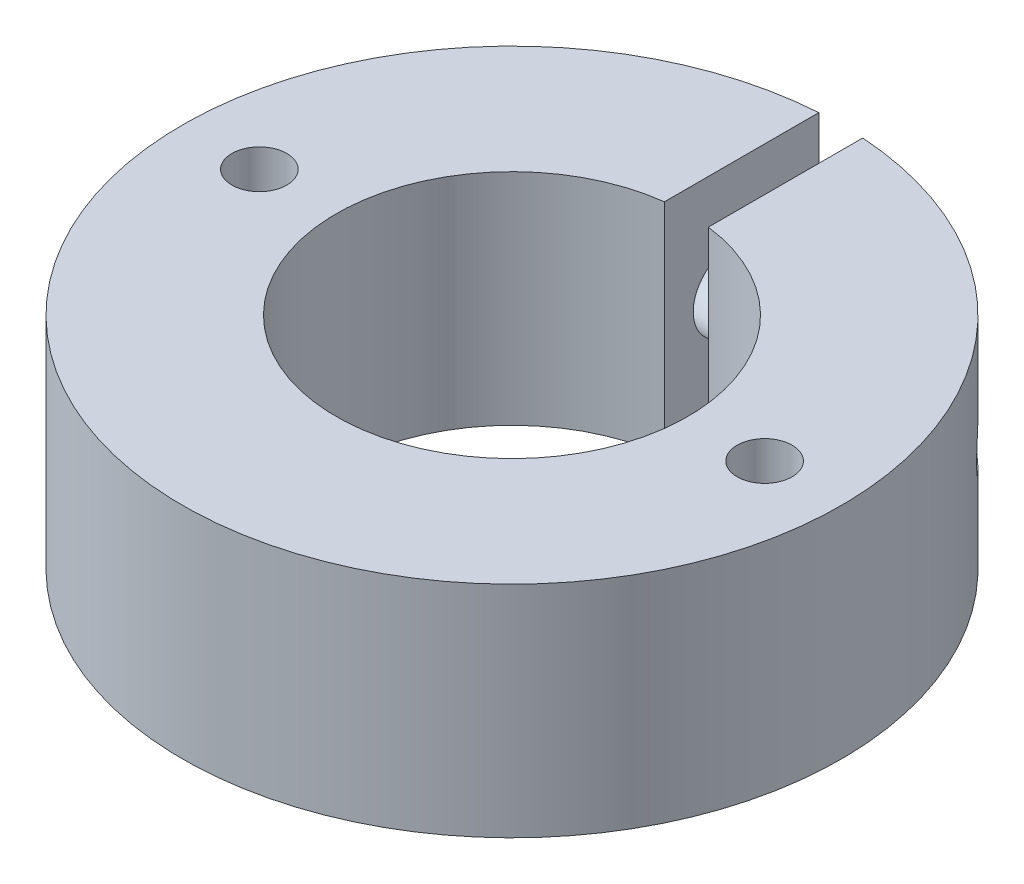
ISO-10303-21;
HEADER;
FILE_DESCRIPTION(('STEP AP214'),'2;1');
FILE_NAME('part.step','',(''),(''),'','','');
FILE_SCHEMA(('AUTOMOTIVE_DESIGN { 1 0 10303 214 1 1 1 1 }'));
ENDSEC;
DATA;
#1=APPLICATION_CONTEXT('core data for automotive mechanical design processes');
#2=APPLICATION_PROTOCOL_DEFINITION('international standard','automotive_design',2000,#1);
#3=PRODUCT_CONTEXT('',#1,'mechanical');
#4=PRODUCT('Part','Part','',(#3));
#5=PRODUCT_RELATED_PRODUCT_CATEGORY('part','',(#4));
#6=PRODUCT_DEFINITION_FORMATION('','',#4);
#7=PRODUCT_DEFINITION_CONTEXT('part definition',#1,'design');
#8=PRODUCT_DEFINITION('design','',#6,#7);
#9=PRODUCT_DEFINITION_SHAPE('','',#8);
#10=(LENGTH_UNIT() NAMED_UNIT(*) SI_UNIT(.MILLI.,.METRE.));
#11=(NAMED_UNIT(*) PLANE_ANGLE_UNIT() SI_UNIT($,.RADIAN.));
#12=(NAMED_UNIT(*) SI_UNIT($,.STERADIAN.) SOLID_ANGLE_UNIT());
#13=UNCERTAINTY_MEASURE_WITH_UNIT(LENGTH_MEASURE(1.E-05),#10,'distance_accuracy_value','');
#14=(GEOMETRIC_REPRESENTATION_CONTEXT(3) GLOBAL_UNCERTAINTY_ASSIGNED_CONTEXT((#13)) GLOBAL_UNIT_ASSIGNED_CONTEXT((#10,
#11,#12)) REPRESENTATION_CONTEXT('',''));
#15=CARTESIAN_POINT('',(0.,0.,0.));
#16=DIRECTION('',(0.,0.,1.));
#17=DIRECTION('',(1.,0.,0.));
#18=AXIS2_PLACEMENT_3D('',#15,#16,#17);
#19=CARTESIAN_POINT('',(-11.5,12.99999999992,0.));
#20=DIRECTION('',(0.,1.,0.));
#21=DIRECTION('',(0.,0.,1.));
#22=AXIS2_PLACEMENT_3D('',#19,#20,#21);
#23=CONICAL_SURFACE('',#22,1.24999999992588,1.0297442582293);
#24=CARTESIAN_POINT('',(-11.5,12.2489242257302,0.));
#25=VERTEX_POINT('',#24);
#26=VERTEX_LOOP('',#25);
#27=FACE_BOUND('',#26,.T.);
#28=CARTESIAN_POINT('',(-11.5,13.,0.));
#29=DIRECTION('',(0.,1.,0.));
#30=DIRECTION('',(0.,0.,1.));
#31=AXIS2_PLACEMENT_3D('',#28,#29,#30);
#32=CIRCLE('',#31,1.24999999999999);
#33=CARTESIAN_POINT('',(-11.5,13.,1.25));
#34=VERTEX_POINT('',#33);
#35=EDGE_CURVE('E92',#34,#34,#32,.T.);
#36=ORIENTED_EDGE('',*,*,#35,.T.);
#37=EDGE_LOOP('',(#36));
#38=FACE_BOUND('',#37,.T.);
#39=ADVANCED_FACE('F17',(#27,#38),#23,.F.);
#40=CARTESIAN_POINT('',(11.5,12.99999999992,0.));
#41=DIRECTION('',(0.,1.,0.));
#42=DIRECTION('',(-1.,0.,0.));
#43=AXIS2_PLACEMENT_3D('',#40,#41,#42);
#44=CONICAL_SURFACE('',#43,1.24999999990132,1.02974425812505);
#45=CARTESIAN_POINT('',(11.5,12.2489242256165,0.));
#46=VERTEX_POINT('',#45);
#47=VERTEX_LOOP('',#46);
#48=FACE_BOUND('',#47,.T.);
#49=CARTESIAN_POINT('',(11.5,13.,0.));
#50=DIRECTION('',(0.,1.,0.));
#51=DIRECTION('',(0.,0.,1.));
#52=AXIS2_PLACEMENT_3D('',#49,#50,#51);
#53=CIRCLE('',#52,1.24999999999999);
#54=CARTESIAN_POINT('',(11.5,13.,1.25));
#55=VERTEX_POINT('',#54);
#56=EDGE_CURVE('E94',#55,#55,#53,.T.);
#57=ORIENTED_EDGE('',*,*,#56,.T.);
#58=EDGE_LOOP('',(#57));
#59=FACE_BOUND('',#58,.T.);
#60=ADVANCED_FACE('F89',(#48,#59),#44,.F.);
#61=CARTESIAN_POINT('',(-11.5,22.,0.));
#62=DIRECTION('',(0.,1.,0.));
#63=DIRECTION('',(0.,0.,1.));
#64=AXIS2_PLACEMENT_3D('',#61,#62,#63);
#65=CYLINDRICAL_SURFACE('',#64,1.24999999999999);
#66=ORIENTED_EDGE('',*,*,#35,.F.);
#67=EDGE_LOOP('',(#66));
#68=FACE_BOUND('',#67,.T.);
#69=CARTESIAN_POINT('',(-11.5,22.,0.));
#70=DIRECTION('',(0.,1.,0.));
#71=DIRECTION('',(0.,0.,1.));
#72=AXIS2_PLACEMENT_3D('',#69,#70,#71);
#73=CIRCLE('',#72,1.24999999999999);
#74=CARTESIAN_POINT('',(-11.5,22.,1.25));
#75=VERTEX_POINT('',#74);
#76=EDGE_CURVE('E165',#75,#75,#73,.F.);
#77=ORIENTED_EDGE('',*,*,#76,.F.);
#78=EDGE_LOOP('',(#77));
#79=FACE_BOUND('',#78,.T.);
#80=ADVANCED_FACE('F150',(#68,#79),#65,.F.);
#81=CARTESIAN_POINT('',(11.5,22.,0.));
#82=DIRECTION('',(0.,1.,0.));
#83=DIRECTION('',(0.,0.,1.));
#84=AXIS2_PLACEMENT_3D('',#81,#82,#83);
#85=CYLINDRICAL_SURFACE('',#84,1.24999999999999);
#86=ORIENTED_EDGE('',*,*,#56,.F.);
#87=EDGE_LOOP('',(#86));
#88=FACE_BOUND('',#87,.T.);
#89=CARTESIAN_POINT('',(11.5,22.,0.));
#90=DIRECTION('',(0.,1.,0.));
#91=DIRECTION('',(0.,0.,1.));
#92=AXIS2_PLACEMENT_3D('',#89,#90,#91);
#93=CIRCLE('',#92,1.24999999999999);
#94=CARTESIAN_POINT('',(11.5,22.,1.25));
#95=VERTEX_POINT('',#94);
#96=EDGE_CURVE('E162',#95,#95,#93,.F.);
#97=ORIENTED_EDGE('',*,*,#96,.F.);
#98=EDGE_LOOP('',(#97));
#99=FACE_BOUND('',#98,.T.);
#100=ADVANCED_FACE('F146',(#88,#99),#85,.F.);
#101=CARTESIAN_POINT('',(-16.,17.,-11.));
#102=DIRECTION('',(1.,0.,0.));
#103=DIRECTION('',(0.,0.,-1.));
#104=AXIS2_PLACEMENT_3D('',#101,#102,#103);
#105=CYLINDRICAL_SURFACE('',#104,1.75);
#106=CARTESIAN_POINT('',(-4.,17.,-11.));
#107=DIRECTION('',(1.,0.,0.));
#108=DIRECTION('',(0.,0.,-1.));
#109=AXIS2_PLACEMENT_3D('',#106,#107,#108);
#110=CIRCLE('',#109,1.75);
#111=CARTESIAN_POINT('',(-4.,17.,-12.75));
#112=VERTEX_POINT('',#111);
#113=EDGE_CURVE('E176',#112,#112,#110,.F.);
#114=ORIENTED_EDGE('',*,*,#113,.T.);
#115=EDGE_LOOP('',(#114));
#116=FACE_BOUND('',#115,.T.);
#117=CARTESIAN_POINT('',(-0.999999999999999,17.,-11.));
#118=DIRECTION('',(1.,0.,0.));
#119=DIRECTION('',(0.,0.,-1.));
#120=AXIS2_PLACEMENT_3D('',#117,#118,#119);
#121=CIRCLE('',#120,1.75);
#122=CARTESIAN_POINT('',(-0.999999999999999,17.,-12.75));
#123=VERTEX_POINT('',#122);
#124=EDGE_CURVE('E172',#123,#123,#121,.T.);
#125=ORIENTED_EDGE('',*,*,#124,.T.);
#126=EDGE_LOOP('',(#125));
#127=FACE_BOUND('',#126,.T.);
#128=ADVANCED_FACE('F142',(#116,#127),#105,.F.);
#129=CARTESIAN_POINT('',(0.,22.,0.));
#130=DIRECTION('',(0.,-1.,0.));
#131=DIRECTION('',(0.,0.,-1.));
#132=AXIS2_PLACEMENT_3D('',#129,#130,#131);
#133=CYLINDRICAL_SURFACE('',#132,8.);
#134=DIRECTION('',(0.,1.,0.));
#135=VECTOR('',#134,1.);
#136=CARTESIAN_POINT('',(-1.,-0.001000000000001,-7.93725393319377));
#137=LINE('',#136,#135);
#138=CARTESIAN_POINT('',(-1.,12.,-7.93725393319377));
#139=VERTEX_POINT('',#138);
#140=CARTESIAN_POINT('',(-1.,22.,-7.93725393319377));
#141=VERTEX_POINT('',#140);
#142=EDGE_CURVE('E164',#139,#141,#137,.T.);
#143=ORIENTED_EDGE('',*,*,#142,.T.);
#144=CARTESIAN_POINT('',(0.,22.,0.));
#145=DIRECTION('',(0.,-1.,0.));
#146=DIRECTION('',(0.,0.,-1.));
#147=AXIS2_PLACEMENT_3D('',#144,#145,#146);
#148=CIRCLE('',#147,8.);
#149=CARTESIAN_POINT('',(1.,22.,-7.93725393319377));
#150=VERTEX_POINT('',#149);
#151=EDGE_CURVE('E169',#150,#141,#148,.T.);
#152=ORIENTED_EDGE('',*,*,#151,.F.);
#153=DIRECTION('',(0.,1.,0.));
#154=VECTOR('',#153,1.);
#155=CARTESIAN_POINT('',(1.,-0.001000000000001,-7.93725393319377));
#156=LINE('',#155,#154);
#157=CARTESIAN_POINT('',(1.,12.,-7.93725393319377));
#158=VERTEX_POINT('',#157);
#159=EDGE_CURVE('E197',#150,#158,#156,.F.);
#160=ORIENTED_EDGE('',*,*,#159,.T.);
#161=CARTESIAN_POINT('',(0.,12.,0.));
#162=DIRECTION('',(0.,-1.,0.));
#163=DIRECTION('',(0.,0.,-1.));
#164=AXIS2_PLACEMENT_3D('',#161,#162,#163);
#165=CIRCLE('',#164,8.);
#166=EDGE_CURVE('E206',#139,#158,#165,.F.);
#167=ORIENTED_EDGE('',*,*,#166,.F.);
#168=EDGE_LOOP('',(#143,#152,#160,#167));
#169=FACE_BOUND('',#168,.T.);
#170=ADVANCED_FACE('F138',(#169),#133,.F.);
#171=CARTESIAN_POINT('',(-4.,20.25,-11.));
#172=DIRECTION('',(0.,-1.,0.));
#173=DIRECTION('',(0.,0.,-1.));
#174=AXIS2_PLACEMENT_3D('',#171,#172,#173);
#175=PLANE('',#174);
#176=DIRECTION('',(-1.,0.,0.));
#177=VECTOR('',#176,1.);
#178=CARTESIAN_POINT('',(-4.,20.25,-11.));
#179=LINE('',#178,#177);
#180=CARTESIAN_POINT('',(-4.,20.25,-11.));
#181=VERTEX_POINT('',#180);
#182=CARTESIAN_POINT('',(-10.1980390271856,20.25,-11.));
#183=VERTEX_POINT('',#182);
#184=EDGE_CURVE('E97',#181,#183,#179,.T.);
#185=ORIENTED_EDGE('',*,*,#184,.T.);
#186=CARTESIAN_POINT('',(0.,20.25,0.));
#187=DIRECTION('',(0.,-1.,0.));
#188=DIRECTION('',(0.,0.,-1.));
#189=AXIS2_PLACEMENT_3D('',#186,#187,#188);
#190=CIRCLE('',#189,15.);
#191=CARTESIAN_POINT('',(-4.,20.25,-14.456832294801));
#192=VERTEX_POINT('',#191);
#193=EDGE_CURVE('E126',#192,#183,#190,.F.);
#194=ORIENTED_EDGE('',*,*,#193,.F.);
#195=DIRECTION('',(0.,0.,-1.));
#196=VECTOR('',#195,1.);
#197=CARTESIAN_POINT('',(-4.,20.25,-11.));
#198=LINE('',#197,#196);
#199=EDGE_CURVE('E184',#192,#181,#198,.F.);
#200=ORIENTED_EDGE('',*,*,#199,.T.);
#201=EDGE_LOOP('',(#185,#194,#200));
#202=FACE_BOUND('',#201,.T.);
#203=ADVANCED_FACE('F134',(#202),#175,.T.);
#204=CARTESIAN_POINT('',(-4.,17.,-11.));
#205=DIRECTION('',(-1.,0.,0.));
#206=DIRECTION('',(0.,0.,1.));
#207=AXIS2_PLACEMENT_3D('',#204,#205,#206);
#208=CYLINDRICAL_SURFACE('',#207,3.25);
#209=CARTESIAN_POINT('',(-4.,17.,-11.));
#210=DIRECTION('',(-1.,0.,0.));
#211=DIRECTION('',(0.,0.,1.));
#212=AXIS2_PLACEMENT_3D('',#209,#210,#211);
#213=CIRCLE('',#212,3.25);
#214=CARTESIAN_POINT('',(-4.,13.75,-11.));
#215=VERTEX_POINT('',#214);
#216=EDGE_CURVE('E20',#181,#215,#213,.F.);
#217=ORIENTED_EDGE('',*,*,#216,.T.);
#218=DIRECTION('',(1.,0.,0.));
#219=VECTOR('',#218,1.);
#220=CARTESIAN_POINT('',(-4.,13.75,-11.));
#221=LINE('',#220,#219);
#222=CARTESIAN_POINT('',(-10.1980390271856,13.75,-11.));
#223=VERTEX_POINT('',#222);
#224=EDGE_CURVE('E190',#223,#215,#221,.T.);
#225=ORIENTED_EDGE('',*,*,#224,.F.);
#226=CARTESIAN_POINT('',(-10.1980390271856,20.25,-11.));
#227=CARTESIAN_POINT('',(-10.2981954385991,20.2499900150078,-10.9071623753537));
#228=CARTESIAN_POINT('',(-10.3971037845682,20.2460195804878,-10.8129051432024));
#229=CARTESIAN_POINT('',(-10.5920863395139,20.229367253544,-10.6219705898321));
#230=CARTESIAN_POINT('',(-10.6881560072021,20.2166721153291,-10.5252898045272));
#231=CARTESIAN_POINT('',(-10.8776631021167,20.1816182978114,-10.329336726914));
#232=CARTESIAN_POINT('',(-10.9710691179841,20.1591738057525,-10.2300489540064));
#233=CARTESIAN_POINT('',(-11.1536661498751,20.1038004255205,-10.030654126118));
#234=CARTESIAN_POINT('',(-11.2428597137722,20.0708779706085,-9.93054761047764));
#235=CARTESIAN_POINT('',(-11.4674013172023,19.9710539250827,-9.6717465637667));
#236=CARTESIAN_POINT('',(-11.5991619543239,19.8955464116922,-9.51310087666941));
#237=CARTESIAN_POINT('',(-11.8471474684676,19.7135686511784,-9.20241607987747));
#238=CARTESIAN_POINT('',(-11.9634286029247,19.6072152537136,-9.05035448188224));
#239=CARTESIAN_POINT('',(-12.1613206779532,19.3810335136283,-8.78212222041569));
#240=CARTESIAN_POINT('',(-12.2455131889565,19.2657991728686,-8.66402983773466));
#241=CARTESIAN_POINT('',(-12.3606003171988,19.0762463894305,-8.49824296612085));
#242=CARTESIAN_POINT('',(-12.3971219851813,19.0102154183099,-8.44483212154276));
#243=CARTESIAN_POINT('',(-12.4662130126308,18.8728388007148,-8.34250157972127));
#244=CARTESIAN_POINT('',(-12.4987840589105,18.80149544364,-8.29357996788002));
#245=CARTESIAN_POINT('',(-12.5599825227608,18.6533602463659,-8.20060742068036));
#246=CARTESIAN_POINT('',(-12.5885826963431,18.5765357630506,-8.15659050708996));
#247=CARTESIAN_POINT('',(-12.641400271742,18.4183870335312,-8.07448953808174));
#248=CARTESIAN_POINT('',(-12.6656197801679,18.3370649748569,-8.03640263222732));
#249=CARTESIAN_POINT('',(-12.7095233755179,18.1705787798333,-7.9667879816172));
#250=CARTESIAN_POINT('',(-12.7292121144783,18.0854186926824,-7.93525351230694));
#251=CARTESIAN_POINT('',(-12.7639634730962,17.9119367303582,-7.87923346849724));
#252=CARTESIAN_POINT('',(-12.7790276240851,17.8236159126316,-7.8547455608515));
#253=CARTESIAN_POINT('',(-12.8087017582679,17.6146188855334,-7.806294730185));
#254=CARTESIAN_POINT('',(-12.8214799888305,17.4929875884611,-7.78523822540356));
#255=CARTESIAN_POINT('',(-12.8385295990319,17.2475871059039,-7.75708811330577));
#256=CARTESIAN_POINT('',(-12.8428020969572,17.123818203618,-7.74999267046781));
#257=CARTESIAN_POINT('',(-12.8427962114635,16.8389256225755,-7.75000953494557));
#258=CARTESIAN_POINT('',(-12.8355580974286,16.6777678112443,-7.76203927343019));
#259=CARTESIAN_POINT('',(-12.8067067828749,16.3602147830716,-7.80954548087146));
#260=CARTESIAN_POINT('',(-12.7850832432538,16.2038230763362,-7.84503881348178));
#261=CARTESIAN_POINT('',(-12.7278886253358,15.9006368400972,-7.93749160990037));
#262=CARTESIAN_POINT('',(-12.692348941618,15.7538215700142,-7.99440274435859));
#263=CARTESIAN_POINT('',(-12.6079531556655,15.4730388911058,-8.12684763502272));
#264=CARTESIAN_POINT('',(-12.5590957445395,15.339072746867,-8.20238322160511));
#265=CARTESIAN_POINT('',(-12.4469876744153,15.0820998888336,-8.37156628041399));
#266=CARTESIAN_POINT('',(-12.3832856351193,14.9596548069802,-8.46576385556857));
#267=CARTESIAN_POINT('',(-12.2438324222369,14.7330871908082,-8.66622541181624));
#268=CARTESIAN_POINT('',(-12.168084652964,14.6289594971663,-8.77248598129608));
#269=CARTESIAN_POINT('',(-11.9961732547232,14.4281135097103,-9.00640316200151));
#270=CARTESIAN_POINT('',(-11.898650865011,14.3337783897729,-9.13509782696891));
#271=CARTESIAN_POINT('',(-11.6919187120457,14.1678280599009,-9.3982512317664));
#272=CARTESIAN_POINT('',(-11.5826740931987,14.0962832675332,-9.53272640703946));
#273=CARTESIAN_POINT('',(-11.3732526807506,13.9846479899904,-9.7811606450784));
#274=CARTESIAN_POINT('',(-11.2744920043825,13.9413338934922,-9.89489829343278));
#275=CARTESIAN_POINT('',(-11.071179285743,13.8686105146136,-10.1218690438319));
#276=CARTESIAN_POINT('',(-10.9666203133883,13.8392182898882,-10.2351013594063));
#277=CARTESIAN_POINT('',(-10.7534639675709,13.7933543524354,-10.458809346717));
#278=CARTESIAN_POINT('',(-10.6448987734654,13.7767964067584,-10.5692985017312));
#279=CARTESIAN_POINT('',(-10.4240957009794,13.7551413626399,-10.7871401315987));
#280=CARTESIAN_POINT('',(-10.3118680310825,13.7500147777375,-10.8944999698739));
#281=CARTESIAN_POINT('',(-10.1980390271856,13.75,-11.));
#282=B_SPLINE_CURVE_WITH_KNOTS('',3,(#226,#227,#228,#229,#230,#231,#232,#233,#234,#235,#236,
#237,#238,#239,#240,#241,#242,#243,#244,#245,#246,#247,#248,#249,#250,#251,#252,#253,#254,#255,
#256,#257,#258,#259,#260,#261,#262,#263,#264,#265,#266,#267,#268,#269,#270,#271,#272,#273,#274,
#275,#276,#277,#278,#279,#280,#281),.UNSPECIFIED.,.F.,.F.,(4,2,2,2,2,2,2,2,2,2,2,2,2,2,2,2,2,2,
2,2,2,2,2,2,2,2,2,4),(0.,0.409698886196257,0.820021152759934,1.23403063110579,1.64778640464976,
2.30403999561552,2.957839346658,3.51100192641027,3.7880539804,4.06498732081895,4.34373557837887,
4.62234943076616,4.90067592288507,5.17891015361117,5.55006308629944,5.92116721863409,
6.40393441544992,6.88704896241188,7.36907983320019,7.8511580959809,8.35043813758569,
8.84957732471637,9.40853008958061,9.9691935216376,10.4386453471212,10.9086708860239,
11.3755102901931,11.8411441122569),.UNSPECIFIED.);
#283=EDGE_CURVE('E117',#183,#223,#282,.T.);
#284=ORIENTED_EDGE('',*,*,#283,.F.);
#285=ORIENTED_EDGE('',*,*,#184,.F.);
#286=EDGE_LOOP('',(#217,#225,#284,#285));
#287=FACE_BOUND('',#286,.T.);
#288=ADVANCED_FACE('F128',(#287),#208,.F.);
#289=CARTESIAN_POINT('',(-4.,13.75,-14.9666295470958));
#290=DIRECTION('',(0.,1.,0.));
#291=DIRECTION('',(0.,0.,1.));
#292=AXIS2_PLACEMENT_3D('',#289,#290,#291);
#293=PLANE('',#292);
#294=DIRECTION('',(0.,0.,-1.));
#295=VECTOR('',#294,1.);
#296=CARTESIAN_POINT('',(-4.,13.75,-11.));
#297=LINE('',#296,#295);
#298=CARTESIAN_POINT('',(-4.,13.75,-14.456832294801));
#299=VERTEX_POINT('',#298);
#300=EDGE_CURVE('E178',#215,#299,#297,.T.);
#301=ORIENTED_EDGE('',*,*,#300,.T.);
#302=CARTESIAN_POINT('',(0.,13.75,0.));
#303=DIRECTION('',(0.,-1.,0.));
#304=DIRECTION('',(0.,0.,-1.));
#305=AXIS2_PLACEMENT_3D('',#302,#303,#304);
#306=CIRCLE('',#305,15.);
#307=EDGE_CURVE('E125',#223,#299,#306,.T.);
#308=ORIENTED_EDGE('',*,*,#307,.F.);
#309=ORIENTED_EDGE('',*,*,#224,.T.);
#310=EDGE_LOOP('',(#301,#308,#309));
#311=FACE_BOUND('',#310,.T.);
#312=ADVANCED_FACE('F133',(#311),#293,.T.);
#313=CARTESIAN_POINT('',(-4.,17.,-11.));
#314=DIRECTION('',(1.,0.,0.));
#315=DIRECTION('',(0.,0.,-1.));
#316=AXIS2_PLACEMENT_3D('',#313,#314,#315);
#317=PLANE('',#316);
#318=ORIENTED_EDGE('',*,*,#113,.F.);
#319=EDGE_LOOP('',(#318));
#320=FACE_BOUND('',#319,.T.);
#321=ORIENTED_EDGE('',*,*,#216,.F.);
#322=ORIENTED_EDGE('',*,*,#199,.F.);
#323=DIRECTION('',(0.,-1.,0.));
#324=VECTOR('',#323,1.);
#325=CARTESIAN_POINT('',(-4.,22.,-14.456832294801));
#326=LINE('',#325,#324);
#327=EDGE_CURVE('E192',#299,#192,#326,.F.);
#328=ORIENTED_EDGE('',*,*,#327,.F.);
#329=ORIENTED_EDGE('',*,*,#300,.F.);
#330=EDGE_LOOP('',(#321,#322,#328,#329));
#331=FACE_BOUND('',#330,.T.);
#332=ADVANCED_FACE('F241',(#320,#331),#317,.F.);
#333=CARTESIAN_POINT('',(0.,22.,0.));
#334=DIRECTION('',(0.,1.,0.));
#335=DIRECTION('',(0.,0.,1.));
#336=AXIS2_PLACEMENT_3D('',#333,#334,#335);
#337=PLANE('',#336);
#338=ORIENTED_EDGE('',*,*,#96,.T.);
#339=EDGE_LOOP('',(#338));
#340=FACE_BOUND('',#339,.T.);
#341=ORIENTED_EDGE('',*,*,#76,.T.);
#342=EDGE_LOOP('',(#341));
#343=FACE_BOUND('',#342,.T.);
#344=DIRECTION('',(0.,0.,-1.));
#345=VECTOR('',#344,1.);
#346=CARTESIAN_POINT('',(1.,22.,-7.12249684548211));
#347=LINE('',#346,#345);
#348=CARTESIAN_POINT('',(1.,22.,-14.9666295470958));
#349=VERTEX_POINT('',#348);
#350=EDGE_CURVE('E187',#349,#150,#347,.F.);
#351=ORIENTED_EDGE('',*,*,#350,.T.);
#352=ORIENTED_EDGE('',*,*,#151,.T.);
#353=DIRECTION('',(0.,0.,1.));
#354=VECTOR('',#353,1.);
#355=CARTESIAN_POINT('',(-1.,22.,-7.12249684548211));
#356=LINE('',#355,#354);
#357=CARTESIAN_POINT('',(-1.,22.,-14.9666295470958));
#358=VERTEX_POINT('',#357);
#359=EDGE_CURVE('E167',#141,#358,#356,.F.);
#360=ORIENTED_EDGE('',*,*,#359,.T.);
#361=CARTESIAN_POINT('',(0.,22.,0.));
#362=DIRECTION('',(0.,-1.,0.));
#363=DIRECTION('',(0.,0.,-1.));
#364=AXIS2_PLACEMENT_3D('',#361,#362,#363);
#365=CIRCLE('',#364,15.);
#366=EDGE_CURVE('E195',#349,#358,#365,.T.);
#367=ORIENTED_EDGE('',*,*,#366,.F.);
#368=EDGE_LOOP('',(#351,#352,#360,#367));
#369=FACE_BOUND('',#368,.T.);
#370=ADVANCED_FACE('F225',(#340,#343,#369),#337,.T.);
#371=CARTESIAN_POINT('',(-1.,-0.001000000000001,-7.12249684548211));
#372=DIRECTION('',(-1.,0.,0.));
#373=DIRECTION('',(0.,0.,1.));
#374=AXIS2_PLACEMENT_3D('',#371,#372,#373);
#375=PLANE('',#374);
#376=ORIENTED_EDGE('',*,*,#124,.F.);
#377=EDGE_LOOP('',(#376));
#378=FACE_BOUND('',#377,.T.);
#379=DIRECTION('',(0.,-1.,0.));
#380=VECTOR('',#379,1.);
#381=CARTESIAN_POINT('',(-1.,22.,-14.9666295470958));
#382=LINE('',#381,#380);
#383=CARTESIAN_POINT('',(-1.,12.,-14.9666295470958));
#384=VERTEX_POINT('',#383);
#385=EDGE_CURVE('E218',#358,#384,#382,.T.);
#386=ORIENTED_EDGE('',*,*,#385,.F.);
#387=ORIENTED_EDGE('',*,*,#359,.F.);
#388=ORIENTED_EDGE('',*,*,#142,.F.);
#389=DIRECTION('',(0.,0.,-1.));
#390=VECTOR('',#389,1.);
#391=CARTESIAN_POINT('',(-1.,12.,0.));
#392=LINE('',#391,#390);
#393=EDGE_CURVE('E208',#384,#139,#392,.F.);
#394=ORIENTED_EDGE('',*,*,#393,.F.);
#395=EDGE_LOOP('',(#386,#387,#388,#394));
#396=FACE_BOUND('',#395,.T.);
#397=ADVANCED_FACE('F230',(#378,#396),#375,.F.);
#398=CARTESIAN_POINT('',(0.,12.,0.));
#399=DIRECTION('',(0.,-1.,0.));
#400=DIRECTION('',(0.,0.,-1.));
#401=AXIS2_PLACEMENT_3D('',#398,#399,#400);
#402=PLANE('',#401);
#403=DIRECTION('',(0.,0.,-1.));
#404=VECTOR('',#403,1.);
#405=CARTESIAN_POINT('',(1.,12.,-7.12249684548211));
#406=LINE('',#405,#404);
#407=CARTESIAN_POINT('',(1.,12.,-14.9666295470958));
#408=VERTEX_POINT('',#407);
#409=EDGE_CURVE('E35',#158,#408,#406,.T.);
#410=ORIENTED_EDGE('',*,*,#409,.T.);
#411=CARTESIAN_POINT('',(0.,12.,0.));
#412=DIRECTION('',(0.,-1.,0.));
#413=DIRECTION('',(0.,0.,-1.));
#414=AXIS2_PLACEMENT_3D('',#411,#412,#413);
#415=CIRCLE('',#414,15.);
#416=EDGE_CURVE('E106',#384,#408,#415,.F.);
#417=ORIENTED_EDGE('',*,*,#416,.F.);
#418=ORIENTED_EDGE('',*,*,#393,.T.);
#419=ORIENTED_EDGE('',*,*,#166,.T.);
#420=EDGE_LOOP('',(#410,#417,#418,#419));
#421=FACE_BOUND('',#420,.T.);
#422=ADVANCED_FACE('F228',(#421),#402,.T.);
#423=CARTESIAN_POINT('',(1.,-0.001000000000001,-7.12249684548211));
#424=DIRECTION('',(1.,0.,0.));
#425=DIRECTION('',(0.,0.,-1.));
#426=AXIS2_PLACEMENT_3D('',#423,#424,#425);
#427=PLANE('',#426);
#428=CARTESIAN_POINT('',(1.,17.,-11.));
#429=DIRECTION('',(-1.,0.,0.));
#430=DIRECTION('',(0.,0.,1.));
#431=AXIS2_PLACEMENT_3D('',#428,#429,#430);
#432=CIRCLE('',#431,1.25);
#433=CARTESIAN_POINT('',(1.,17.,-9.75));
#434=VERTEX_POINT('',#433);
#435=EDGE_CURVE('E199',#434,#434,#432,.F.);
#436=ORIENTED_EDGE('',*,*,#435,.T.);
#437=EDGE_LOOP('',(#436));
#438=FACE_BOUND('',#437,.T.);
#439=ORIENTED_EDGE('',*,*,#350,.F.);
#440=DIRECTION('',(0.,-1.,0.));
#441=VECTOR('',#440,1.);
#442=CARTESIAN_POINT('',(1.,22.,-14.9666295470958));
#443=LINE('',#442,#441);
#444=EDGE_CURVE('E26',#408,#349,#443,.F.);
#445=ORIENTED_EDGE('',*,*,#444,.F.);
#446=ORIENTED_EDGE('',*,*,#409,.F.);
#447=ORIENTED_EDGE('',*,*,#159,.F.);
#448=EDGE_LOOP('',(#439,#445,#446,#447));
#449=FACE_BOUND('',#448,.T.);
#450=ADVANCED_FACE('F227',(#438,#449),#427,.F.);
#451=CARTESIAN_POINT('',(1.,17.,-11.));
#452=DIRECTION('',(-1.,0.,0.));
#453=DIRECTION('',(0.,0.,1.));
#454=AXIS2_PLACEMENT_3D('',#451,#452,#453);
#455=CYLINDRICAL_SURFACE('',#454,1.25);
#456=ORIENTED_EDGE('',*,*,#435,.F.);
#457=EDGE_LOOP('',(#456));
#458=FACE_BOUND('',#457,.T.);
#459=CARTESIAN_POINT('',(11.399013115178,17.,-9.75));
#460=CARTESIAN_POINT('',(11.3990098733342,17.0577126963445,-9.75000433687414));
#461=CARTESIAN_POINT('',(11.3955719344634,17.1154714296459,-9.75402762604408));
#462=CARTESIAN_POINT('',(11.38202007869,17.2291372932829,-9.7698373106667));
#463=CARTESIAN_POINT('',(11.3718980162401,17.2850420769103,-9.78163317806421));
#464=CARTESIAN_POINT('',(11.345619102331,17.3931057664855,-9.81210092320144));
#465=CARTESIAN_POINT('',(11.3294925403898,17.4452819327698,-9.83073828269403));
#466=CARTESIAN_POINT('',(11.2919777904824,17.5451143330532,-9.87380637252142));
#467=CARTESIAN_POINT('',(11.2705881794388,17.5927693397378,-9.89823866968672));
#468=CARTESIAN_POINT('',(11.2158875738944,17.6972265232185,-9.96022369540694));
#469=CARTESIAN_POINT('',(11.180945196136,17.7521619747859,-9.99948292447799));
#470=CARTESIAN_POINT('',(11.1050726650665,17.8527471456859,-10.0836793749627));
#471=CARTESIAN_POINT('',(11.0641325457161,17.8983811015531,-10.1286260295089));
#472=CARTESIAN_POINT('',(10.9631560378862,17.9943654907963,-10.2379886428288));
#473=CARTESIAN_POINT('',(10.9013255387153,18.0411479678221,-10.3038716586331));
#474=CARTESIAN_POINT('',(10.7720775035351,18.1197405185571,-10.4389246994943));
#475=CARTESIAN_POINT('',(10.7046515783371,18.1515276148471,-10.5080995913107));
#476=CARTESIAN_POINT('',(10.5418119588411,18.2102797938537,-10.6718183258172));
#477=CARTESIAN_POINT('',(10.4448381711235,18.2316972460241,-10.7667962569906));
#478=CARTESIAN_POINT('',(10.2471023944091,18.2527935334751,-10.9551648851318));
#479=CARTESIAN_POINT('',(10.146335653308,18.252444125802,-11.0485533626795));
#480=CARTESIAN_POINT('',(9.94133782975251,18.2316063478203,-11.2333985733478));
#481=CARTESIAN_POINT('',(9.83707819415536,18.2107017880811,-11.3247754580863));
#482=CARTESIAN_POINT('',(9.62961284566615,18.1487345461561,-11.5016990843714));
#483=CARTESIAN_POINT('',(9.52640643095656,18.1076863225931,-11.5872499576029));
#484=CARTESIAN_POINT('',(9.35229143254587,18.0186029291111,-11.7278955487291));
#485=CARTESIAN_POINT('',(9.28032047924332,17.9756109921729,-11.7848860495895));
#486=CARTESIAN_POINT('',(9.14078066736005,17.8772862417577,-11.8934380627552));
#487=CARTESIAN_POINT('',(9.07320471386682,17.8219739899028,-11.9450084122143));
#488=CARTESIAN_POINT('',(8.96813969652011,17.7187983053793,-12.0239427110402));
#489=CARTESIAN_POINT('',(8.92833504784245,17.674987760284,-12.0535051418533));
#490=CARTESIAN_POINT('',(8.85391156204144,17.5806789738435,-12.1082767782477));
#491=CARTESIAN_POINT('',(8.81928514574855,17.5301907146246,-12.1334923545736));
#492=CARTESIAN_POINT('',(8.76577024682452,17.4362903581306,-12.172184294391));
#493=CARTESIAN_POINT('',(8.74512977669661,17.394444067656,-12.1870088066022));
#494=CARTESIAN_POINT('',(8.70949297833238,17.3072298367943,-12.2125023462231));
#495=CARTESIAN_POINT('',(8.69448596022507,17.2618687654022,-12.2231792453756));
#496=CARTESIAN_POINT('',(8.67441549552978,17.1803510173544,-12.237427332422));
#497=CARTESIAN_POINT('',(8.66779647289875,17.1447717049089,-12.2421131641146));
#498=CARTESIAN_POINT('',(8.65890852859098,17.0728017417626,-12.2484011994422));
#499=CARTESIAN_POINT('',(8.65663908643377,17.036411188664,-12.2500037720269));
#500=CARTESIAN_POINT('',(8.65665287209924,16.9492690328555,-12.2499947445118));
#501=CARTESIAN_POINT('',(8.66107758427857,16.8984980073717,-12.2468712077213));
#502=CARTESIAN_POINT('',(8.67816496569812,16.7990686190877,-12.234768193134));
#503=CARTESIAN_POINT('',(8.69084425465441,16.7504147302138,-12.225776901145));
#504=CARTESIAN_POINT('',(8.7227395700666,16.6572607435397,-12.2030400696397));
#505=CARTESIAN_POINT('',(8.74187468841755,16.612717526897,-12.1893533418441));
#506=CARTESIAN_POINT('',(8.78515432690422,16.5276296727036,-12.1581979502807));
#507=CARTESIAN_POINT('',(8.80930078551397,16.4870865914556,-12.1407278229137));
#508=CARTESIAN_POINT('',(8.87767752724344,16.3856903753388,-12.090887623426));
#509=CARTESIAN_POINT('',(8.92497800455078,16.3281301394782,-12.0560637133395));
#510=CARTESIAN_POINT('',(9.02555725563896,16.2225412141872,-11.9809553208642));
#511=CARTESIAN_POINT('',(9.0788541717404,16.1745427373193,-11.9406541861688));
#512=CARTESIAN_POINT('',(9.17754603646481,16.0962474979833,-11.8648926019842));
#513=CARTESIAN_POINT('',(9.22226531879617,16.0643475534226,-11.8301801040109));
#514=CARTESIAN_POINT('',(9.3132746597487,16.0054810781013,-11.7586680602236));
#515=CARTESIAN_POINT('',(9.35956559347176,15.9785173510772,-11.7218673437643));
#516=CARTESIAN_POINT('',(9.50000406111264,15.9045598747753,-11.608803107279));
#517=CARTESIAN_POINT('',(9.5957194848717,15.8644981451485,-11.5298758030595));
#518=CARTESIAN_POINT('',(9.79246858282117,15.8005021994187,-11.363315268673));
#519=CARTESIAN_POINT('',(9.89355329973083,15.7773399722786,-11.2754531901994));
#520=CARTESIAN_POINT('',(10.0947264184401,15.7503650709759,-11.0957039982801));
#521=CARTESIAN_POINT('',(10.194815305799,15.7465424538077,-11.0038189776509));
#522=CARTESIAN_POINT('',(10.3814538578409,15.7591189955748,-10.8277485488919));
#523=CARTESIAN_POINT('',(10.4683258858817,15.7734480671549,-10.743761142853));
#524=CARTESIAN_POINT('',(10.6374593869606,15.8207860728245,-10.5763192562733));
#525=CARTESIAN_POINT('',(10.7197266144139,15.8537710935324,-10.4928642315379));
#526=CARTESIAN_POINT('',(10.8553864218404,15.9288684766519,-10.3521690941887));
#527=CARTESIAN_POINT('',(10.9105344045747,15.9660373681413,-10.2939874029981));
#528=CARTESIAN_POINT('',(11.015367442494,16.0524103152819,-10.1817257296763));
#529=CARTESIAN_POINT('',(11.0650600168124,16.1015974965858,-10.1276401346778));
#530=CARTESIAN_POINT('',(11.1469098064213,16.2004129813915,-10.0373941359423));
#531=CARTESIAN_POINT('',(11.1805273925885,16.2476035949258,-9.99989742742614));
#532=CARTESIAN_POINT('',(11.2419445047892,16.3495448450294,-9.93080135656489));
#533=CARTESIAN_POINT('',(11.2697492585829,16.4042886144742,-9.89919669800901));
#534=CARTESIAN_POINT('',(11.3143273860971,16.5113397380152,-9.84819586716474));
#535=CARTESIAN_POINT('',(11.3321496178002,16.5626653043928,-9.82765971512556));
#536=CARTESIAN_POINT('',(11.3618568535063,16.6691103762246,-9.79330025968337));
#537=CARTESIAN_POINT('',(11.3737520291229,16.7242231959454,-9.7794654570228));
#538=CARTESIAN_POINT('',(11.3878730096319,16.8164226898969,-9.7630126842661));
#539=CARTESIAN_POINT('',(11.392039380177,16.8528321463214,-9.75814827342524));
#540=CARTESIAN_POINT('',(11.3976107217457,16.9261547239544,-9.75164025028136));
#541=CARTESIAN_POINT('',(11.3990151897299,16.9630679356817,-9.74999722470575));
#542=CARTESIAN_POINT('',(11.399013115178,17.,-9.75));
#543=B_SPLINE_CURVE_WITH_KNOTS('',3,(#459,#460,#461,#462,#463,#464,#465,#466,#467,#468,#469,
#470,#471,#472,#473,#474,#475,#476,#477,#478,#479,#480,#481,#482,#483,#484,#485,#486,#487,#488,
#489,#490,#491,#492,#493,#494,#495,#496,#497,#498,#499,#500,#501,#502,#503,#504,#505,#506,#507,
#508,#509,#510,#511,#512,#513,#514,#515,#516,#517,#518,#519,#520,#521,#522,#523,#524,#525,#526,
#527,#528,#529,#530,#531,#532,#533,#534,#535,#536,#537,#538,#539,#540,#541,#542),.UNSPECIFIED.,
.T.,.F.,(4,2,2,2,2,2,2,2,2,2,2,2,2,2,2,2,2,2,2,2,2,2,2,2,2,2,2,2,2,2,2,2,2,2,2,2,2,2,2,2,2,4),
(0.,0.172983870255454,0.346178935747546,0.518511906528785,0.690891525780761,0.917731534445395,
1.14495283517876,1.44852751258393,1.75256585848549,2.16263530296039,2.57323683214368,
2.99232684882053,3.41111649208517,3.71449056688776,4.01736207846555,4.21535738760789,
4.4130600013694,4.55943627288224,4.70553336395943,4.81464071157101,4.92373500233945,
5.07573385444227,5.22803969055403,5.37850357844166,5.52902577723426,5.77436073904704,
6.02045900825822,6.21513789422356,6.40992701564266,6.79949557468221,7.2059037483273,
7.61210295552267,7.97588245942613,8.33919672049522,8.60341503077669,8.86726447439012,
9.0735470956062,9.27964339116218,9.45317483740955,9.62640744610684,9.73708479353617,
9.84778229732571),.UNSPECIFIED.);
#544=CARTESIAN_POINT('',(11.399013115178,17.,-9.75));
#545=VERTEX_POINT('',#544);
#546=EDGE_CURVE('E11',#545,#545,#543,.T.);
#547=ORIENTED_EDGE('',*,*,#546,.F.);
#548=EDGE_LOOP('',(#547));
#549=FACE_BOUND('',#548,.T.);
#550=ADVANCED_FACE('F108',(#458,#549),#455,.F.);
#551=CARTESIAN_POINT('',(0.,22.,0.));
#552=DIRECTION('',(0.,-1.,0.));
#553=DIRECTION('',(0.,0.,-1.));
#554=AXIS2_PLACEMENT_3D('',#551,#552,#553);
#555=CYLINDRICAL_SURFACE('',#554,15.);
#556=ORIENTED_EDGE('',*,*,#546,.T.);
#557=EDGE_LOOP('',(#556));
#558=FACE_BOUND('',#557,.T.);
#559=ORIENTED_EDGE('',*,*,#416,.T.);
#560=ORIENTED_EDGE('',*,*,#444,.T.);
#561=ORIENTED_EDGE('',*,*,#366,.T.);
#562=ORIENTED_EDGE('',*,*,#385,.T.);
#563=EDGE_LOOP('',(#559,#560,#561,#562));
#564=FACE_BOUND('',#563,.T.);
#565=ORIENTED_EDGE('',*,*,#307,.T.);
#566=ORIENTED_EDGE('',*,*,#327,.T.);
#567=ORIENTED_EDGE('',*,*,#193,.T.);
#568=ORIENTED_EDGE('',*,*,#283,.T.);
#569=EDGE_LOOP('',(#565,#566,#567,#568));
#570=FACE_BOUND('',#569,.T.);
#571=ADVANCED_FACE('F111',(#558,#564,#570),#555,.T.);
#572=CLOSED_SHELL('',(#39,#60,#80,#100,#128,#170,#203,#288,#312,#332,#370,#397,#422,#450,#550,#571));
#573=MANIFOLD_SOLID_BREP('B1',#572);
#574=ADVANCED_BREP_SHAPE_REPRESENTATION('',(#18,#573),#14);
#575=SHAPE_DEFINITION_REPRESENTATION(#9,#574);
ENDSEC;
END-ISO-10303-21;
